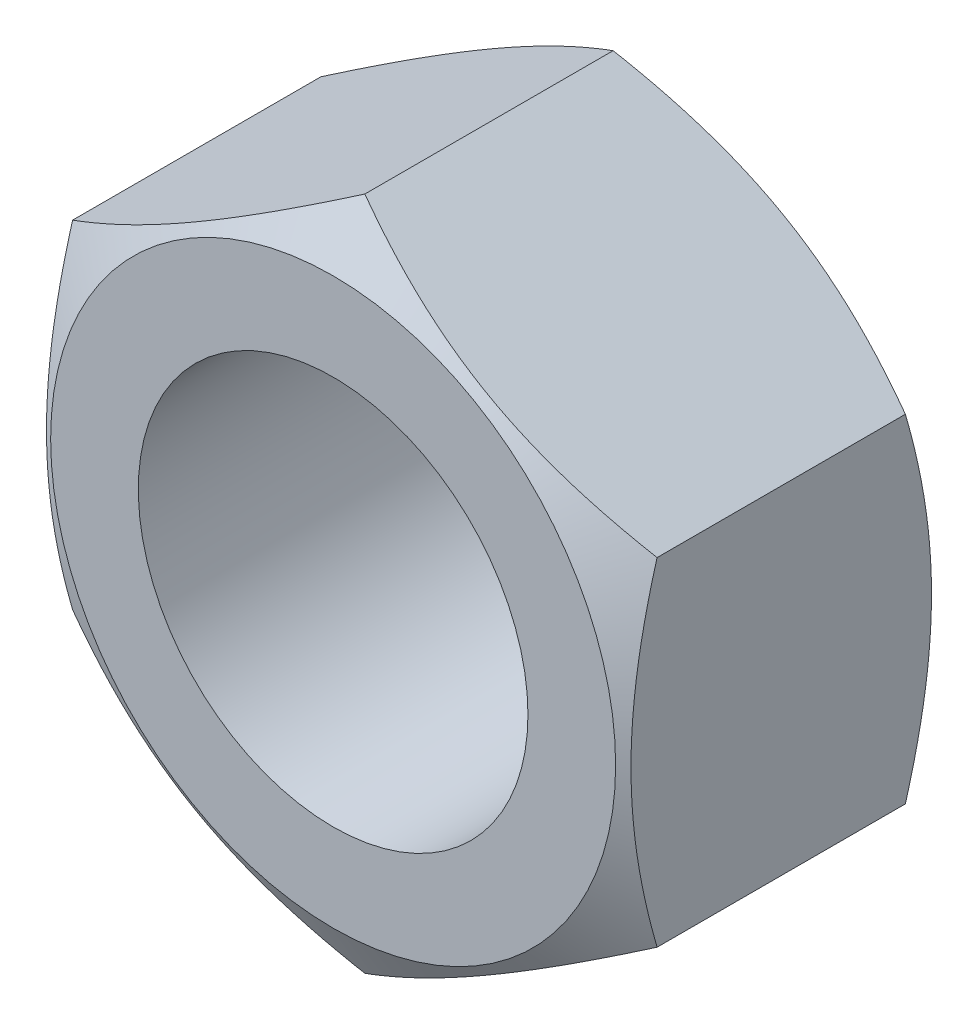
ISO-10303-21;
HEADER;
FILE_DESCRIPTION(('STEP AP214'),'2;1');
FILE_NAME('part.step','',(''),(''),'','','');
FILE_SCHEMA(('AUTOMOTIVE_DESIGN { 1 0 10303 214 1 1 1 1 }'));
ENDSEC;
DATA;
#1=APPLICATION_CONTEXT('core data for automotive mechanical design processes');
#2=APPLICATION_PROTOCOL_DEFINITION('international standard','automotive_design',2000,#1);
#3=PRODUCT_CONTEXT('',#1,'mechanical');
#4=PRODUCT('Part','Part','',(#3));
#5=PRODUCT_RELATED_PRODUCT_CATEGORY('part','',(#4));
#6=PRODUCT_DEFINITION_FORMATION('','',#4);
#7=PRODUCT_DEFINITION_CONTEXT('part definition',#1,'design');
#8=PRODUCT_DEFINITION('design','',#6,#7);
#9=PRODUCT_DEFINITION_SHAPE('','',#8);
#10=(LENGTH_UNIT() NAMED_UNIT(*) SI_UNIT(.MILLI.,.METRE.));
#11=(NAMED_UNIT(*) PLANE_ANGLE_UNIT() SI_UNIT($,.RADIAN.));
#12=(NAMED_UNIT(*) SI_UNIT($,.STERADIAN.) SOLID_ANGLE_UNIT());
#13=UNCERTAINTY_MEASURE_WITH_UNIT(LENGTH_MEASURE(1.E-05),#10,'distance_accuracy_value','');
#14=(GEOMETRIC_REPRESENTATION_CONTEXT(3) GLOBAL_UNCERTAINTY_ASSIGNED_CONTEXT((#13)) GLOBAL_UNIT_ASSIGNED_CONTEXT((#10,
#11,#12)) REPRESENTATION_CONTEXT('',''));
#15=CARTESIAN_POINT('',(0.,0.,0.));
#16=DIRECTION('',(0.,0.,1.));
#17=DIRECTION('',(1.,0.,0.));
#18=AXIS2_PLACEMENT_3D('',#15,#16,#17);
#19=CARTESIAN_POINT('',(-15.,-8.66025403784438,18.));
#20=DIRECTION('',(-1.,0.,0.));
#21=DIRECTION('',(0.,0.,1.));
#22=AXIS2_PLACEMENT_3D('',#19,#20,#21);
#23=PLANE('',#22);
#24=DIRECTION('',(0.,0.,-1.));
#25=VECTOR('',#24,1.);
#26=CARTESIAN_POINT('',(-15.,-8.66025403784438,18.));
#27=LINE('',#26,#25);
#28=CARTESIAN_POINT('',(-15.,-8.66025403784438,14.3715789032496));
#29=VERTEX_POINT('',#28);
#30=CARTESIAN_POINT('',(-15.,-8.66025403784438,1.62842109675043));
#31=VERTEX_POINT('',#30);
#32=EDGE_CURVE('E9',#29,#31,#27,.T.);
#33=ORIENTED_EDGE('',*,*,#32,.F.);
#34=CARTESIAN_POINT('',(-15.,-23.1406505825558,8.45000329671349));
#35=CARTESIAN_POINT('',(-15.,-22.8135927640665,8.60845031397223));
#36=CARTESIAN_POINT('',(-15.,-22.4861478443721,8.76609791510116));
#37=CARTESIAN_POINT('',(-15.,-21.8304029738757,9.07961298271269));
#38=CARTESIAN_POINT('',(-15.,-21.5021030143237,9.23548043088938));
#39=CARTESIAN_POINT('',(-15.,-20.5157102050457,9.70018246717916));
#40=CARTESIAN_POINT('',(-15.,-19.8562230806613,10.0060688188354));
#41=CARTESIAN_POINT('',(-15.,-18.5291467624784,10.6097795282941));
#42=CARTESIAN_POINT('',(-15.,-17.8615329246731,10.907549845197));
#43=CARTESIAN_POINT('',(-15.,-16.5209530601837,11.4907454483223));
#44=CARTESIAN_POINT('',(-15.,-15.8479872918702,11.7761713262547));
#45=CARTESIAN_POINT('',(-15.,-14.4743920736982,12.3401281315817));
#46=CARTESIAN_POINT('',(-15.,-13.7735572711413,12.6181615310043));
#47=CARTESIAN_POINT('',(-15.,-12.3636384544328,13.1528899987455));
#48=CARTESIAN_POINT('',(-15.,-11.654553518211,13.4095826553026));
#49=CARTESIAN_POINT('',(-15.,-10.2283968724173,13.8947978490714));
#50=CARTESIAN_POINT('',(-15.,-9.51134509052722,14.123378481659));
#51=CARTESIAN_POINT('',(-15.,-8.06688859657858,14.5449667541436));
#52=CARTESIAN_POINT('',(-15.,-7.3394872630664,14.7379857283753));
#53=CARTESIAN_POINT('',(-15.,-6.24250938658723,14.9932735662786));
#54=CARTESIAN_POINT('',(-15.,-5.87685361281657,15.0724966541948));
#55=CARTESIAN_POINT('',(-15.,-5.14306674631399,15.2185732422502));
#56=CARTESIAN_POINT('',(-15.,-4.77493570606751,15.2854270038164));
#57=CARTESIAN_POINT('',(-15.,-4.03645965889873,15.4055777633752));
#58=CARTESIAN_POINT('',(-15.,-3.66611466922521,15.4588748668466));
#59=CARTESIAN_POINT('',(-15.,-2.92361618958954,15.5508441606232));
#60=CARTESIAN_POINT('',(-15.,-2.5514627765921,15.5895169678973));
#61=CARTESIAN_POINT('',(-15.,-1.81067042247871,15.6509916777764));
#62=CARTESIAN_POINT('',(-15.,-1.44204802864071,15.6739917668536));
#63=CARTESIAN_POINT('',(-15.,-0.704162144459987,15.7043911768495));
#64=CARTESIAN_POINT('',(-15.,-0.334898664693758,15.7117907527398));
#65=CARTESIAN_POINT('',(-15.,0.403612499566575,15.7108135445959));
#66=CARTESIAN_POINT('',(-15.,0.772860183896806,15.7024366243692));
#67=CARTESIAN_POINT('',(-15.,1.51067677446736,15.6701086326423));
#68=CARTESIAN_POINT('',(-15.,1.87924564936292,15.6461568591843));
#69=CARTESIAN_POINT('',(-15.,2.76875443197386,15.570059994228));
#70=CARTESIAN_POINT('',(-15.,3.28905562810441,15.5103186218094));
#71=CARTESIAN_POINT('',(-15.,4.32571881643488,15.3630808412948));
#72=CARTESIAN_POINT('',(-15.,4.84208024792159,15.2755805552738));
#73=CARTESIAN_POINT('',(-15.,5.87039831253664,15.0759378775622));
#74=CARTESIAN_POINT('',(-15.,6.38235110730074,14.9637759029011));
#75=CARTESIAN_POINT('',(-15.,7.40108345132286,14.7182253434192));
#76=CARTESIAN_POINT('',(-15.,7.90786308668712,14.5848371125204));
#77=CARTESIAN_POINT('',(-15.,8.92732305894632,14.2969394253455));
#78=CARTESIAN_POINT('',(-15.,9.43989023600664,14.1420320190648));
#79=CARTESIAN_POINT('',(-15.,10.4599739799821,13.8164792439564));
#80=CARTESIAN_POINT('',(-15.,10.9674905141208,13.6458337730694));
#81=CARTESIAN_POINT('',(-15.,11.9777284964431,13.2914909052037));
#82=CARTESIAN_POINT('',(-15.,12.4804515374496,13.1077980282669));
#83=CARTESIAN_POINT('',(-15.,13.481749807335,12.7294951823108));
#84=CARTESIAN_POINT('',(-15.,13.9803250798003,12.5348853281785));
#85=CARTESIAN_POINT('',(-15.,15.1361574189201,12.0714695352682));
#86=CARTESIAN_POINT('',(-15.,15.7920237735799,11.7992006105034));
#87=CARTESIAN_POINT('',(-15.,17.0983559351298,11.2419658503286));
#88=CARTESIAN_POINT('',(-15.,17.7488214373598,10.9569993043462));
#89=CARTESIAN_POINT('',(-15.,19.0453309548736,10.3768556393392));
#90=CARTESIAN_POINT('',(-15.,19.6913740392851,10.0816764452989));
#91=CARTESIAN_POINT('',(-15.,20.9796270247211,9.48311992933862));
#92=CARTESIAN_POINT('',(-15.,21.6218369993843,9.17974276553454));
#93=CARTESIAN_POINT('',(-15.,22.9037017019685,8.56597645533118));
#94=CARTESIAN_POINT('',(-15.,23.5433531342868,8.25558043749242));
#95=CARTESIAN_POINT('',(-15.,24.8199402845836,7.62925447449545));
#96=CARTESIAN_POINT('',(-15.,25.4568759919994,7.31332450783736));
#97=CARTESIAN_POINT('',(-15.,26.7283656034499,6.67689845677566));
#98=CARTESIAN_POINT('',(-15.,27.3629197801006,6.35640291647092));
#99=CARTESIAN_POINT('',(-15.,28.6300597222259,5.71154185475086));
#100=CARTESIAN_POINT('',(-15.,29.2626454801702,5.3871763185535));
#101=CARTESIAN_POINT('',(-15.,31.0553792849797,4.46207897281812));
#102=CARTESIAN_POINT('',(-15.,32.2135265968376,3.85746993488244));
#103=CARTESIAN_POINT('',(-15.,34.5255051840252,2.63998448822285));
#104=CARTESIAN_POINT('',(-15.,35.6793363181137,2.02710781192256));
#105=CARTESIAN_POINT('',(-15.,37.9808909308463,0.796449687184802));
#106=CARTESIAN_POINT('',(-15.,39.1286223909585,0.178683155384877));
#107=CARTESIAN_POINT('',(-15.,40.8481732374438,-0.751673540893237));
#108=CARTESIAN_POINT('',(-15.,41.4210012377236,-1.06240229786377));
#109=CARTESIAN_POINT('',(-15.,42.566050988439,-1.68497281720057));
#110=CARTESIAN_POINT('',(-15.,43.1382727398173,-1.99681457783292));
#111=CARTESIAN_POINT('',(-15.,43.7102252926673,-2.30914944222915));
#112=B_SPLINE_CURVE_WITH_KNOTS('',3,(#34,#35,#36,#37,#38,#39,#40,#41,#42,#43,#44,#45,#46,#47,
#48,#49,#50,#51,#52,#53,#54,#55,#56,#57,#58,#59,#60,#61,#62,#63,#64,#65,#66,#67,#68,#69,#70,#71,
#72,#73,#74,#75,#76,#77,#78,#79,#80,#81,#82,#83,#84,#85,#86,#87,#88,#89,#90,#91,#92,#93,#94,#95,
#96,#97,#98,#99,#100,#101,#102,#103,#104,#105,#106,#107,#108,#109,#110,#111),.UNSPECIFIED.,.F.,
.F.,(4,2,2,2,2,2,2,2,2,2,2,2,2,2,2,2,2,2,2,2,2,2,2,2,2,2,2,2,2,2,2,2,2,2,2,2,2,2,4),(0.,
1.09025046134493,2.18051212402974,4.36136447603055,6.5542967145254,8.74712372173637,
11.0087708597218,13.2706732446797,15.5278197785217,17.7842456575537,18.9064890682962,
20.0287087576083,21.1509197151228,22.27308332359,23.3807795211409,24.4884576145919,
25.5961452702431,26.7038828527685,28.2741704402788,29.8446774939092,31.4164361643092,
32.9881686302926,34.5942572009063,36.2003561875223,37.8059014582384,39.4114298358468,
41.5416541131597,43.6719977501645,45.8027768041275,47.9335147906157,50.0664377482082,
52.1993689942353,54.3320481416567,56.4647354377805,60.3840875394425,64.3035667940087,
68.2138323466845,70.1688655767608,72.1238957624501),.UNSPECIFIED.);
#113=CARTESIAN_POINT('',(-15.,8.66025403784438,14.3715789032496));
#114=VERTEX_POINT('',#113);
#115=EDGE_CURVE('E69',#29,#114,#112,.T.);
#116=ORIENTED_EDGE('',*,*,#115,.T.);
#117=DIRECTION('',(0.,0.,-1.));
#118=VECTOR('',#117,1.);
#119=CARTESIAN_POINT('',(-15.,8.66025403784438,18.));
#120=LINE('',#119,#118);
#121=CARTESIAN_POINT('',(-15.,8.66025403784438,1.62842109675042));
#122=VERTEX_POINT('',#121);
#123=EDGE_CURVE('E38',#114,#122,#120,.T.);
#124=ORIENTED_EDGE('',*,*,#123,.T.);
#125=CARTESIAN_POINT('',(-15.,-23.4699725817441,7.70987638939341));
#126=CARTESIAN_POINT('',(-15.,-23.1415247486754,7.55009582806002));
#127=CARTESIAN_POINT('',(-15.,-22.8126970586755,7.39109647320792));
#128=CARTESIAN_POINT('',(-15.,-22.1542027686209,7.07483670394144));
#129=CARTESIAN_POINT('',(-15.,-21.8245361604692,6.91757630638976));
#130=CARTESIAN_POINT('',(-15.,-20.8340741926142,6.44862821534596));
#131=CARTESIAN_POINT('',(-15.,-20.1719106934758,6.13981947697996));
#132=CARTESIAN_POINT('',(-15.,-18.8397161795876,5.53008911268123));
#133=CARTESIAN_POINT('',(-15.,-18.1696620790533,5.22921780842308));
#134=CARTESIAN_POINT('',(-15.,-16.8242973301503,4.63950891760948));
#135=CARTESIAN_POINT('',(-15.,-16.1489869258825,4.35067077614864));
#136=CARTESIAN_POINT('',(-15.,-14.7694563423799,3.77884634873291));
#137=CARTESIAN_POINT('',(-15.,-14.0650218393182,3.49637447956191));
#138=CARTESIAN_POINT('',(-15.,-12.6479834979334,2.95231005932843));
#139=CARTESIAN_POINT('',(-15.,-11.9353787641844,2.69071982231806));
#140=CARTESIAN_POINT('',(-15.,-10.5021570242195,2.19513846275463));
#141=CARTESIAN_POINT('',(-15.,-9.78155888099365,1.96109321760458));
#142=CARTESIAN_POINT('',(-15.,-8.32996018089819,1.52796027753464));
#143=CARTESIAN_POINT('',(-15.,-7.59896291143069,1.32886178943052));
#144=CARTESIAN_POINT('',(-15.,-6.49655522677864,1.06407217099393));
#145=CARTESIAN_POINT('',(-15.,-6.12914358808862,0.981636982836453));
#146=CARTESIAN_POINT('',(-15.,-5.39177201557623,0.829014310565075));
#147=CARTESIAN_POINT('',(-15.,-5.02181213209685,0.758826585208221));
#148=CARTESIAN_POINT('',(-15.,-4.27958352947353,0.631924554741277));
#149=CARTESIAN_POINT('',(-15.,-3.90731484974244,0.575210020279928));
#150=CARTESIAN_POINT('',(-15.,-3.16084805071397,0.4763779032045));
#151=CARTESIAN_POINT('',(-15.,-2.78665001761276,0.434259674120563));
#152=CARTESIAN_POINT('',(-15.,-2.04182159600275,0.365996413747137));
#153=CARTESIAN_POINT('',(-15.,-1.6712101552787,0.339645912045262));
#154=CARTESIAN_POINT('',(-15.,-0.929205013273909,0.302651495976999));
#155=CARTESIAN_POINT('',(-15.,-0.557811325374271,0.292007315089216));
#156=CARTESIAN_POINT('',(-15.,0.185094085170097,0.286679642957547));
#157=CARTESIAN_POINT('',(-15.,0.556605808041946,0.291996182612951));
#158=CARTESIAN_POINT('',(-15.,1.29906958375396,0.318457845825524));
#159=CARTESIAN_POINT('',(-15.,1.6700216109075,0.339603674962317));
#160=CARTESIAN_POINT('',(-15.,2.55529607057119,0.408502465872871));
#161=CARTESIAN_POINT('',(-15.,3.06907123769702,0.463418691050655));
#162=CARTESIAN_POINT('',(-15.,4.0929473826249,0.60067399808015));
#163=CARTESIAN_POINT('',(-15.,4.60304787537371,0.683016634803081));
#164=CARTESIAN_POINT('',(-15.,5.61903977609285,0.872195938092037));
#165=CARTESIAN_POINT('',(-15.,6.12492772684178,0.979050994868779));
#166=CARTESIAN_POINT('',(-15.,7.13169797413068,1.21398339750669));
#167=CARTESIAN_POINT('',(-15.,7.63258033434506,1.34206047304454));
#168=CARTESIAN_POINT('',(-15.,8.64055583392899,1.6193908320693));
#169=CARTESIAN_POINT('',(-15.,9.14753485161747,1.76905601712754));
#170=CARTESIAN_POINT('',(-15.,10.1565015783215,2.08427311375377));
#171=CARTESIAN_POINT('',(-15.,10.6584892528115,2.24982513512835));
#172=CARTESIAN_POINT('',(-15.,11.6577149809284,2.5941503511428));
#173=CARTESIAN_POINT('',(-15.,12.1549544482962,2.77291946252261));
#174=CARTESIAN_POINT('',(-15.,13.1452841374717,3.14153420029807));
#175=CARTESIAN_POINT('',(-15.,13.6383744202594,3.33137966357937));
#176=CARTESIAN_POINT('',(-15.,14.8483575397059,3.81036828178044));
#177=CARTESIAN_POINT('',(-15.,15.56315957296,4.10478661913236));
#178=CARTESIAN_POINT('',(-15.,16.9862746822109,4.70895725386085));
#179=CARTESIAN_POINT('',(-15.,17.6945872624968,5.0187107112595));
#180=CARTESIAN_POINT('',(-15.,19.1060111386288,5.65031881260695));
#181=CARTESIAN_POINT('',(-15.,19.8091209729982,5.97217671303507));
#182=CARTESIAN_POINT('',(-15.,21.2108662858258,6.62541845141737));
#183=CARTESIAN_POINT('',(-15.,21.9095018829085,6.95680203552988));
#184=CARTESIAN_POINT('',(-15.,23.3039583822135,7.62764773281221));
#185=CARTESIAN_POINT('',(-15.,23.9997746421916,7.96711947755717));
#186=CARTESIAN_POINT('',(-15.,25.3883291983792,8.65230055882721));
#187=CARTESIAN_POINT('',(-15.,26.081067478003,8.998009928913));
#188=CARTESIAN_POINT('',(-15.,27.4638560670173,9.69449620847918));
#189=CARTESIAN_POINT('',(-15.,28.1539067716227,10.0452723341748));
#190=CARTESIAN_POINT('',(-15.,29.5318258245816,10.751076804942));
#191=CARTESIAN_POINT('',(-15.,30.2196941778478,11.1061051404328));
#192=CARTESIAN_POINT('',(-15.,32.1564022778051,12.1120352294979));
#193=CARTESIAN_POINT('',(-15.,33.4031142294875,12.7670332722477));
#194=CARTESIAN_POINT('',(-15.,35.8919889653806,14.0857235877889));
#195=CARTESIAN_POINT('',(-15.,37.1341515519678,14.7494162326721));
#196=CARTESIAN_POINT('',(-15.,39.6114638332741,16.0815417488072));
#197=CARTESIAN_POINT('',(-15.,40.8466234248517,16.7499562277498));
#198=CARTESIAN_POINT('',(-15.,42.6972399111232,17.7563859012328));
#199=CARTESIAN_POINT('',(-15.,43.3137394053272,18.0924867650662));
#200=CARTESIAN_POINT('',(-15.,44.5461141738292,18.7658288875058));
#201=CARTESIAN_POINT('',(-15.,45.1619894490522,19.1030701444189));
#202=CARTESIAN_POINT('',(-15.,45.777588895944,19.440814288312));
#203=B_SPLINE_CURVE_WITH_KNOTS('',3,(#125,#126,#127,#128,#129,#130,#131,#132,#133,#134,#135,
#136,#137,#138,#139,#140,#141,#142,#143,#144,#145,#146,#147,#148,#149,#150,#151,#152,#153,#154,
#155,#156,#157,#158,#159,#160,#161,#162,#163,#164,#165,#166,#167,#168,#169,#170,#171,#172,#173,
#174,#175,#176,#177,#178,#179,#180,#181,#182,#183,#184,#185,#186,#187,#188,#189,#190,#191,#192,
#193,#194,#195,#196,#197,#198,#199,#200,#201,#202),.UNSPECIFIED.,.F.,.F.,(4,2,2,2,2,2,2,2,2,2,2,
2,2,2,2,2,2,2,2,2,2,2,2,2,2,2,2,2,2,2,2,2,2,2,2,2,2,2,4),(0.,1.09574908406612,2.19150878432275,
4.38334194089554,6.58676146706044,8.79007927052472,11.0667025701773,13.3435778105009,
15.6159018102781,17.887522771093,19.0169896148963,20.1464342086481,21.2758595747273,
22.4052349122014,23.5195532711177,24.6338527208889,25.7481543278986,26.8625056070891,
28.4117584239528,29.961212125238,31.5118321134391,33.0624323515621,34.6479488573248,
36.233476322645,37.8185159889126,39.4035323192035,41.7224664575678,44.041576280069,
46.3613145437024,48.6809910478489,51.0035835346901,53.3261885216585,55.6484379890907,
57.9706822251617,62.1955342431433,66.4205676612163,70.6338128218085,72.7403063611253,
74.8467967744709),.UNSPECIFIED.);
#204=EDGE_CURVE('E89',#31,#122,#203,.T.);
#205=ORIENTED_EDGE('',*,*,#204,.F.);
#206=EDGE_LOOP('',(#33,#116,#124,#205));
#207=FACE_BOUND('',#206,.T.);
#208=ADVANCED_FACE('F14',(#207),#23,.T.);
#209=CARTESIAN_POINT('',(-15.,-8.66025403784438,18.));
#210=DIRECTION('',(0.5,0.86602540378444,0.));
#211=DIRECTION('',(-0.86602540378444,0.5,0.));
#212=AXIS2_PLACEMENT_3D('',#209,#210,#211);
#213=PLANE('',#212);
#214=CARTESIAN_POINT('',(-15.0002,-8.66013856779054,14.3715122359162));
#215=CARTESIAN_POINT('',(-14.6705058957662,-8.85048754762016,14.4814030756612));
#216=CARTESIAN_POINT('',(-14.3395258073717,-9.04157899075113,14.5863072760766));
#217=CARTESIAN_POINT('',(-13.674911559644,-9.42529420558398,14.7847562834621));
#218=CARTESIAN_POINT('',(-13.3412765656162,-9.617918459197,14.8782973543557));
#219=CARTESIAN_POINT('',(-12.6707077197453,-10.0050715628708,15.0527627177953));
#220=CARTESIAN_POINT('',(-12.333767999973,-10.199603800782,15.133657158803));
#221=CARTESIAN_POINT('',(-11.6575472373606,-10.5900200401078,15.2810922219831));
#222=CARTESIAN_POINT('',(-11.3182663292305,-10.7859039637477,15.3476336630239));
#223=CARTESIAN_POINT('',(-10.6460568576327,-11.1740042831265,15.4635324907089));
#224=CARTESIAN_POINT('',(-10.3131781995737,-11.3661918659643,15.5132734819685));
#225=CARTESIAN_POINT('',(-9.64589556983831,-11.7514476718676,15.5966781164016));
#226=CARTESIAN_POINT('',(-9.31149156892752,-11.9445159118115,15.6303414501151));
#227=CARTESIAN_POINT('',(-8.64212181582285,-12.3309767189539,15.6807407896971));
#228=CARTESIAN_POINT('',(-8.30715720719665,-12.5243686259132,15.6974969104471));
#229=CARTESIAN_POINT('',(-7.636918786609,-12.9113309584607,15.7137214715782));
#230=CARTESIAN_POINT('',(-7.30164498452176,-13.104901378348,15.7131904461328));
#231=CARTESIAN_POINT('',(-6.6748531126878,-13.4667798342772,15.696048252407));
#232=CARTESIAN_POINT('',(-6.38329037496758,-13.6351136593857,15.6815280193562));
#233=CARTESIAN_POINT('',(-5.80083556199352,-13.971394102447,15.6396877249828));
#234=CARTESIAN_POINT('',(-5.50994353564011,-14.1393406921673,15.6123667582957));
#235=CARTESIAN_POINT('',(-4.92898814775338,-14.4747554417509,15.5454013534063));
#236=CARTESIAN_POINT('',(-4.63892567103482,-14.6422230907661,15.5057467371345));
#237=CARTESIAN_POINT('',(-4.06016058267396,-14.9763732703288,15.4148097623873));
#238=CARTESIAN_POINT('',(-3.77145806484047,-15.1430557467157,15.3635266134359));
#239=CARTESIAN_POINT('',(-2.89508556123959,-15.6490296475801,15.1909380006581));
#240=CARTESIAN_POINT('',(-2.30995340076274,-15.9868558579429,15.0524236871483));
#241=CARTESIAN_POINT('',(-1.14841408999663,-16.657470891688,14.73805289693));
#242=CARTESIAN_POINT('',(-0.57199206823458,-16.9902683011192,14.5622702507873));
#243=CARTESIAN_POINT('',(0.000200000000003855,-17.3206235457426,14.3715122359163));
#244=B_SPLINE_CURVE_WITH_KNOTS('',3,(#214,#215,#216,#217,#218,#219,#220,#221,#222,#223,#224,
#225,#226,#227,#228,#229,#230,#231,#232,#233,#234,#235,#236,#237,#238,#239,#240,#241,#242,#243),
.UNSPECIFIED.,.F.,.F.,(4,2,2,2,2,2,2,2,2,2,2,2,2,2,4),(0.,1.18875411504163,2.37789802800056,
3.56980778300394,4.76164951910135,5.92407379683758,7.0865204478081,8.24758247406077,
9.40860862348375,10.4193068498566,11.4300765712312,12.4416826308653,13.4533574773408,
15.5211962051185,17.5849760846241),.UNSPECIFIED.);
#245=CARTESIAN_POINT('',(0.,-17.3205080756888,14.3715789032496));
#246=VERTEX_POINT('',#245);
#247=EDGE_CURVE('E77',#29,#246,#244,.T.);
#248=ORIENTED_EDGE('',*,*,#247,.F.);
#249=ORIENTED_EDGE('',*,*,#32,.T.);
#250=CARTESIAN_POINT('',(-15.0002,-8.66013856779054,1.62848776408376));
#251=CARTESIAN_POINT('',(-14.6705058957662,-8.85048754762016,1.51859692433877));
#252=CARTESIAN_POINT('',(-14.3395258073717,-9.04157899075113,1.41369272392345));
#253=CARTESIAN_POINT('',(-13.674911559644,-9.42529420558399,1.21524371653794));
#254=CARTESIAN_POINT('',(-13.3412765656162,-9.61791845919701,1.12170264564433));
#255=CARTESIAN_POINT('',(-12.6707077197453,-10.0050715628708,0.947237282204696));
#256=CARTESIAN_POINT('',(-12.333767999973,-10.199603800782,0.866342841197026));
#257=CARTESIAN_POINT('',(-11.6575472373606,-10.5900200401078,0.718907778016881));
#258=CARTESIAN_POINT('',(-11.3182663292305,-10.7859039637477,0.652366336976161));
#259=CARTESIAN_POINT('',(-10.6460568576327,-11.1740042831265,0.536467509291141));
#260=CARTESIAN_POINT('',(-10.3131781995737,-11.3661918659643,0.4867265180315));
#261=CARTESIAN_POINT('',(-9.6458955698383,-11.7514476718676,0.403321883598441));
#262=CARTESIAN_POINT('',(-9.3114915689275,-11.9445159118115,0.369658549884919));
#263=CARTESIAN_POINT('',(-8.64212181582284,-12.3309767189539,0.319259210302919));
#264=CARTESIAN_POINT('',(-8.30715720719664,-12.5243686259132,0.302503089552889));
#265=CARTESIAN_POINT('',(-7.63691878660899,-12.9113309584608,0.286278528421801));
#266=CARTESIAN_POINT('',(-7.30164498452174,-13.104901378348,0.286809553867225));
#267=CARTESIAN_POINT('',(-6.67485311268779,-13.4667798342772,0.303951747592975));
#268=CARTESIAN_POINT('',(-6.38329037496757,-13.6351136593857,0.318471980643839));
#269=CARTESIAN_POINT('',(-5.80083556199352,-13.971394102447,0.360312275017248));
#270=CARTESIAN_POINT('',(-5.50994353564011,-14.1393406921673,0.387633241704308));
#271=CARTESIAN_POINT('',(-4.92898814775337,-14.4747554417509,0.454598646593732));
#272=CARTESIAN_POINT('',(-4.63892567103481,-14.6422230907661,0.49425326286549));
#273=CARTESIAN_POINT('',(-4.06016058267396,-14.9763732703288,0.585190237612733));
#274=CARTESIAN_POINT('',(-3.77145806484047,-15.1430557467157,0.636473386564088));
#275=CARTESIAN_POINT('',(-2.89508556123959,-15.6490296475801,0.809061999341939));
#276=CARTESIAN_POINT('',(-2.30995340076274,-15.9868558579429,0.947576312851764));
#277=CARTESIAN_POINT('',(-1.14841408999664,-16.657470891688,1.26194710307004));
#278=CARTESIAN_POINT('',(-0.571992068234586,-16.9902683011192,1.4377297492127));
#279=CARTESIAN_POINT('',(0.00019999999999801,-17.3206235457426,1.62848776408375));
#280=B_SPLINE_CURVE_WITH_KNOTS('',3,(#250,#251,#252,#253,#254,#255,#256,#257,#258,#259,#260,
#261,#262,#263,#264,#265,#266,#267,#268,#269,#270,#271,#272,#273,#274,#275,#276,#277,#278,#279),
.UNSPECIFIED.,.F.,.F.,(4,2,2,2,2,2,2,2,2,2,2,2,2,2,4),(0.,1.18875411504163,2.37789802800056,
3.56980778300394,4.76164951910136,5.92407379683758,7.08652044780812,8.24758247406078,
9.40860862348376,10.4193068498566,11.4300765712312,12.4416826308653,13.4533574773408,
15.5211962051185,17.5849760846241),.UNSPECIFIED.);
#281=CARTESIAN_POINT('',(0.,-17.3205080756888,1.62842109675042));
#282=VERTEX_POINT('',#281);
#283=EDGE_CURVE('E111',#31,#282,#280,.T.);
#284=ORIENTED_EDGE('',*,*,#283,.T.);
#285=DIRECTION('',(0.,0.,-1.));
#286=VECTOR('',#285,1.);
#287=CARTESIAN_POINT('',(0.,-17.3205080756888,18.));
#288=LINE('',#287,#286);
#289=EDGE_CURVE('E23',#246,#282,#288,.T.);
#290=ORIENTED_EDGE('',*,*,#289,.F.);
#291=EDGE_LOOP('',(#248,#249,#284,#290));
#292=FACE_BOUND('',#291,.T.);
#293=ADVANCED_FACE('F16',(#292),#213,.F.);
#294=CARTESIAN_POINT('',(15.,-8.66025403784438,18.));
#295=DIRECTION('',(0.5,-0.866025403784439,0.));
#296=DIRECTION('',(0.86602540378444,0.5,0.));
#297=AXIS2_PLACEMENT_3D('',#294,#295,#296);
#298=PLANE('',#297);
#299=DIRECTION('',(0.,0.,-1.));
#300=VECTOR('',#299,1.);
#301=CARTESIAN_POINT('',(15.,-8.66025403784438,18.));
#302=LINE('',#301,#300);
#303=CARTESIAN_POINT('',(15.,-8.66025403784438,14.3715789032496));
#304=VERTEX_POINT('',#303);
#305=CARTESIAN_POINT('',(15.,-8.66025403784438,1.62842109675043));
#306=VERTEX_POINT('',#305);
#307=EDGE_CURVE('E94',#304,#306,#302,.T.);
#308=ORIENTED_EDGE('',*,*,#307,.F.);
#309=CARTESIAN_POINT('',(15.0002,-8.66013856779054,14.3715122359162));
#310=CARTESIAN_POINT('',(14.6705058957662,-8.85048754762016,14.4814030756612));
#311=CARTESIAN_POINT('',(14.3395258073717,-9.04157899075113,14.5863072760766));
#312=CARTESIAN_POINT('',(13.674911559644,-9.42529420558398,14.7847562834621));
#313=CARTESIAN_POINT('',(13.3412765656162,-9.61791845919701,14.8782973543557));
#314=CARTESIAN_POINT('',(12.6707077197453,-10.0050715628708,15.0527627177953));
#315=CARTESIAN_POINT('',(12.333767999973,-10.199603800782,15.133657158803));
#316=CARTESIAN_POINT('',(11.6575472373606,-10.5900200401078,15.2810922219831));
#317=CARTESIAN_POINT('',(11.3182663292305,-10.7859039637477,15.3476336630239));
#318=CARTESIAN_POINT('',(10.6460568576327,-11.1740042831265,15.4635324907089));
#319=CARTESIAN_POINT('',(10.3131781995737,-11.3661918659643,15.5132734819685));
#320=CARTESIAN_POINT('',(9.64589556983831,-11.7514476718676,15.5966781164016));
#321=CARTESIAN_POINT('',(9.31149156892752,-11.9445159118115,15.6303414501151));
#322=CARTESIAN_POINT('',(8.64212181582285,-12.3309767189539,15.6807407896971));
#323=CARTESIAN_POINT('',(8.30715720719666,-12.5243686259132,15.6974969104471));
#324=CARTESIAN_POINT('',(7.636918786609,-12.9113309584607,15.7137214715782));
#325=CARTESIAN_POINT('',(7.30164498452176,-13.104901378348,15.7131904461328));
#326=CARTESIAN_POINT('',(6.6748531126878,-13.4667798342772,15.696048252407));
#327=CARTESIAN_POINT('',(6.38329037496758,-13.6351136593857,15.6815280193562));
#328=CARTESIAN_POINT('',(5.80083556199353,-13.971394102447,15.6396877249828));
#329=CARTESIAN_POINT('',(5.50994353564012,-14.1393406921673,15.6123667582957));
#330=CARTESIAN_POINT('',(4.92898814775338,-14.4747554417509,15.5454013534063));
#331=CARTESIAN_POINT('',(4.63892567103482,-14.6422230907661,15.5057467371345));
#332=CARTESIAN_POINT('',(4.06016058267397,-14.9763732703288,15.4148097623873));
#333=CARTESIAN_POINT('',(3.77145806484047,-15.1430557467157,15.3635266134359));
#334=CARTESIAN_POINT('',(2.8950855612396,-15.6490296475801,15.1909380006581));
#335=CARTESIAN_POINT('',(2.30995340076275,-15.9868558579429,15.0524236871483));
#336=CARTESIAN_POINT('',(1.14841408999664,-16.657470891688,14.73805289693));
#337=CARTESIAN_POINT('',(0.571992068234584,-16.9902683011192,14.5622702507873));
#338=CARTESIAN_POINT('',(-0.000199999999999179,-17.3206235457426,14.3715122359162));
#339=B_SPLINE_CURVE_WITH_KNOTS('',3,(#309,#310,#311,#312,#313,#314,#315,#316,#317,#318,#319,
#320,#321,#322,#323,#324,#325,#326,#327,#328,#329,#330,#331,#332,#333,#334,#335,#336,#337,#338),
.UNSPECIFIED.,.F.,.F.,(4,2,2,2,2,2,2,2,2,2,2,2,2,2,4),(0.,1.18875411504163,2.37789802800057,
3.56980778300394,4.76164951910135,5.92407379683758,7.08652044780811,8.24758247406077,
9.40860862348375,10.4193068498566,11.4300765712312,12.4416826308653,13.4533574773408,
15.5211962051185,17.5849760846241),.UNSPECIFIED.);
#340=EDGE_CURVE('E103',#304,#246,#339,.T.);
#341=ORIENTED_EDGE('',*,*,#340,.T.);
#342=ORIENTED_EDGE('',*,*,#289,.T.);
#343=CARTESIAN_POINT('',(15.0002,-8.66013856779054,1.62848776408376));
#344=CARTESIAN_POINT('',(14.6705058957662,-8.85048754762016,1.51859692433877));
#345=CARTESIAN_POINT('',(14.3395258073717,-9.04157899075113,1.41369272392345));
#346=CARTESIAN_POINT('',(13.674911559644,-9.42529420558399,1.21524371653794));
#347=CARTESIAN_POINT('',(13.3412765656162,-9.61791845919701,1.12170264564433));
#348=CARTESIAN_POINT('',(12.6707077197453,-10.0050715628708,0.947237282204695));
#349=CARTESIAN_POINT('',(12.333767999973,-10.199603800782,0.866342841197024));
#350=CARTESIAN_POINT('',(11.6575472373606,-10.5900200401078,0.718907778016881));
#351=CARTESIAN_POINT('',(11.3182663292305,-10.7859039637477,0.652366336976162));
#352=CARTESIAN_POINT('',(10.6460568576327,-11.1740042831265,0.536467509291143));
#353=CARTESIAN_POINT('',(10.3131781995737,-11.3661918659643,0.486726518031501));
#354=CARTESIAN_POINT('',(9.6458955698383,-11.7514476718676,0.403321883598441));
#355=CARTESIAN_POINT('',(9.3114915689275,-11.9445159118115,0.369658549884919));
#356=CARTESIAN_POINT('',(8.64212181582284,-12.3309767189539,0.31925921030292));
#357=CARTESIAN_POINT('',(8.30715720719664,-12.5243686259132,0.30250308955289));
#358=CARTESIAN_POINT('',(7.63691878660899,-12.9113309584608,0.286278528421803));
#359=CARTESIAN_POINT('',(7.30164498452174,-13.104901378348,0.286809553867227));
#360=CARTESIAN_POINT('',(6.67485311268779,-13.4667798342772,0.303951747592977));
#361=CARTESIAN_POINT('',(6.38329037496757,-13.6351136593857,0.31847198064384));
#362=CARTESIAN_POINT('',(5.80083556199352,-13.9713941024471,0.360312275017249));
#363=CARTESIAN_POINT('',(5.50994353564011,-14.1393406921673,0.387633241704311));
#364=CARTESIAN_POINT('',(4.92898814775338,-14.4747554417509,0.454598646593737));
#365=CARTESIAN_POINT('',(4.63892567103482,-14.6422230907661,0.494253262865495));
#366=CARTESIAN_POINT('',(4.06016058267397,-14.9763732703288,0.585190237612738));
#367=CARTESIAN_POINT('',(3.77145806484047,-15.1430557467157,0.636473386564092));
#368=CARTESIAN_POINT('',(2.89508556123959,-15.6490296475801,0.809061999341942));
#369=CARTESIAN_POINT('',(2.30995340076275,-15.9868558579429,0.947576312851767));
#370=CARTESIAN_POINT('',(1.14841408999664,-16.657470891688,1.26194710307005));
#371=CARTESIAN_POINT('',(0.57199206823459,-16.9902683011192,1.4377297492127));
#372=CARTESIAN_POINT('',(-0.000199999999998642,-17.3206235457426,1.62848776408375));
#373=B_SPLINE_CURVE_WITH_KNOTS('',3,(#343,#344,#345,#346,#347,#348,#349,#350,#351,#352,#353,
#354,#355,#356,#357,#358,#359,#360,#361,#362,#363,#364,#365,#366,#367,#368,#369,#370,#371,#372),
.UNSPECIFIED.,.F.,.F.,(4,2,2,2,2,2,2,2,2,2,2,2,2,2,4),(0.,1.18875411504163,2.37789802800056,
3.56980778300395,4.76164951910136,5.92407379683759,7.08652044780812,8.24758247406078,
9.40860862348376,10.4193068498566,11.4300765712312,12.4416826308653,13.4533574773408,
15.5211962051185,17.5849760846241),.UNSPECIFIED.);
#374=EDGE_CURVE('E102',#306,#282,#373,.T.);
#375=ORIENTED_EDGE('',*,*,#374,.F.);
#376=EDGE_LOOP('',(#308,#341,#342,#375));
#377=FACE_BOUND('',#376,.T.);
#378=ADVANCED_FACE('F101',(#377),#298,.T.);
#379=CARTESIAN_POINT('',(15.,-8.66025403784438,18.));
#380=DIRECTION('',(-1.,0.,0.));
#381=DIRECTION('',(0.,0.,1.));
#382=AXIS2_PLACEMENT_3D('',#379,#380,#381);
#383=PLANE('',#382);
#384=CARTESIAN_POINT('',(15.,-23.1406505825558,8.45000329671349));
#385=CARTESIAN_POINT('',(15.,-22.8135927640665,8.60845031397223));
#386=CARTESIAN_POINT('',(15.,-22.4861478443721,8.76609791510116));
#387=CARTESIAN_POINT('',(15.,-21.8304029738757,9.07961298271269));
#388=CARTESIAN_POINT('',(15.,-21.5021030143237,9.23548043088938));
#389=CARTESIAN_POINT('',(15.,-20.5157102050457,9.70018246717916));
#390=CARTESIAN_POINT('',(15.,-19.8562230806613,10.0060688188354));
#391=CARTESIAN_POINT('',(15.,-18.5291467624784,10.6097795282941));
#392=CARTESIAN_POINT('',(15.,-17.8615329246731,10.907549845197));
#393=CARTESIAN_POINT('',(15.,-16.5209530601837,11.4907454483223));
#394=CARTESIAN_POINT('',(15.,-15.8479872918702,11.7761713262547));
#395=CARTESIAN_POINT('',(15.,-14.4743920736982,12.3401281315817));
#396=CARTESIAN_POINT('',(15.,-13.7735572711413,12.6181615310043));
#397=CARTESIAN_POINT('',(15.,-12.3636384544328,13.1528899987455));
#398=CARTESIAN_POINT('',(15.,-11.654553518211,13.4095826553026));
#399=CARTESIAN_POINT('',(15.,-10.2283968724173,13.8947978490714));
#400=CARTESIAN_POINT('',(15.,-9.51134509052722,14.123378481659));
#401=CARTESIAN_POINT('',(15.,-8.06688859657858,14.5449667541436));
#402=CARTESIAN_POINT('',(15.,-7.3394872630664,14.7379857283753));
#403=CARTESIAN_POINT('',(15.,-6.24250938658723,14.9932735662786));
#404=CARTESIAN_POINT('',(15.,-5.87685361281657,15.0724966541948));
#405=CARTESIAN_POINT('',(15.,-5.14306674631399,15.2185732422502));
#406=CARTESIAN_POINT('',(15.,-4.77493570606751,15.2854270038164));
#407=CARTESIAN_POINT('',(15.,-4.03645965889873,15.4055777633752));
#408=CARTESIAN_POINT('',(15.,-3.66611466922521,15.4588748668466));
#409=CARTESIAN_POINT('',(15.,-2.92361618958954,15.5508441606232));
#410=CARTESIAN_POINT('',(15.,-2.5514627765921,15.5895169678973));
#411=CARTESIAN_POINT('',(15.,-1.81067042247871,15.6509916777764));
#412=CARTESIAN_POINT('',(15.,-1.44204802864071,15.6739917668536));
#413=CARTESIAN_POINT('',(15.,-0.704162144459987,15.7043911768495));
#414=CARTESIAN_POINT('',(15.,-0.334898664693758,15.7117907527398));
#415=CARTESIAN_POINT('',(15.,0.403612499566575,15.7108135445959));
#416=CARTESIAN_POINT('',(15.,0.772860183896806,15.7024366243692));
#417=CARTESIAN_POINT('',(15.,1.51067677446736,15.6701086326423));
#418=CARTESIAN_POINT('',(15.,1.87924564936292,15.6461568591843));
#419=CARTESIAN_POINT('',(15.,2.76875443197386,15.570059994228));
#420=CARTESIAN_POINT('',(15.,3.28905562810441,15.5103186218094));
#421=CARTESIAN_POINT('',(15.,4.32571881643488,15.3630808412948));
#422=CARTESIAN_POINT('',(15.,4.84208024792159,15.2755805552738));
#423=CARTESIAN_POINT('',(15.,5.87039831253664,15.0759378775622));
#424=CARTESIAN_POINT('',(15.,6.38235110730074,14.9637759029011));
#425=CARTESIAN_POINT('',(15.,7.40108345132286,14.7182253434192));
#426=CARTESIAN_POINT('',(15.,7.90786308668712,14.5848371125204));
#427=CARTESIAN_POINT('',(15.,8.92732305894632,14.2969394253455));
#428=CARTESIAN_POINT('',(15.,9.43989023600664,14.1420320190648));
#429=CARTESIAN_POINT('',(15.,10.4599739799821,13.8164792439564));
#430=CARTESIAN_POINT('',(15.,10.9674905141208,13.6458337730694));
#431=CARTESIAN_POINT('',(15.,11.9777284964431,13.2914909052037));
#432=CARTESIAN_POINT('',(15.,12.4804515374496,13.1077980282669));
#433=CARTESIAN_POINT('',(15.,13.481749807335,12.7294951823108));
#434=CARTESIAN_POINT('',(15.,13.9803250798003,12.5348853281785));
#435=CARTESIAN_POINT('',(15.,15.1361574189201,12.0714695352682));
#436=CARTESIAN_POINT('',(15.,15.7920237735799,11.7992006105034));
#437=CARTESIAN_POINT('',(15.,17.0983559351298,11.2419658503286));
#438=CARTESIAN_POINT('',(15.,17.7488214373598,10.9569993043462));
#439=CARTESIAN_POINT('',(15.,19.0453309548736,10.3768556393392));
#440=CARTESIAN_POINT('',(15.,19.6913740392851,10.0816764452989));
#441=CARTESIAN_POINT('',(15.,20.9796270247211,9.48311992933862));
#442=CARTESIAN_POINT('',(15.,21.6218369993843,9.17974276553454));
#443=CARTESIAN_POINT('',(15.,22.9037017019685,8.56597645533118));
#444=CARTESIAN_POINT('',(15.,23.5433531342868,8.25558043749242));
#445=CARTESIAN_POINT('',(15.,24.8199402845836,7.62925447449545));
#446=CARTESIAN_POINT('',(15.,25.4568759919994,7.31332450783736));
#447=CARTESIAN_POINT('',(15.,26.7283656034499,6.67689845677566));
#448=CARTESIAN_POINT('',(15.,27.3629197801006,6.35640291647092));
#449=CARTESIAN_POINT('',(15.,28.6300597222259,5.71154185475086));
#450=CARTESIAN_POINT('',(15.,29.2626454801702,5.3871763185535));
#451=CARTESIAN_POINT('',(15.,31.0553792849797,4.46207897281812));
#452=CARTESIAN_POINT('',(15.,32.2135265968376,3.85746993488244));
#453=CARTESIAN_POINT('',(15.,34.5255051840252,2.63998448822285));
#454=CARTESIAN_POINT('',(15.,35.6793363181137,2.02710781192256));
#455=CARTESIAN_POINT('',(15.,37.9808909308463,0.796449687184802));
#456=CARTESIAN_POINT('',(15.,39.1286223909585,0.178683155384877));
#457=CARTESIAN_POINT('',(15.,40.8481732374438,-0.751673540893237));
#458=CARTESIAN_POINT('',(15.,41.4210012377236,-1.06240229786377));
#459=CARTESIAN_POINT('',(15.,42.566050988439,-1.68497281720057));
#460=CARTESIAN_POINT('',(15.,43.1382727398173,-1.99681457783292));
#461=CARTESIAN_POINT('',(15.,43.7102252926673,-2.30914944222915));
#462=B_SPLINE_CURVE_WITH_KNOTS('',3,(#384,#385,#386,#387,#388,#389,#390,#391,#392,#393,#394,
#395,#396,#397,#398,#399,#400,#401,#402,#403,#404,#405,#406,#407,#408,#409,#410,#411,#412,#413,
#414,#415,#416,#417,#418,#419,#420,#421,#422,#423,#424,#425,#426,#427,#428,#429,#430,#431,#432,
#433,#434,#435,#436,#437,#438,#439,#440,#441,#442,#443,#444,#445,#446,#447,#448,#449,#450,#451,
#452,#453,#454,#455,#456,#457,#458,#459,#460,#461),.UNSPECIFIED.,.F.,.F.,(4,2,2,2,2,2,2,2,2,2,2,
2,2,2,2,2,2,2,2,2,2,2,2,2,2,2,2,2,2,2,2,2,2,2,2,2,2,2,4),(0.,1.09025046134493,2.18051212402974,
4.36136447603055,6.5542967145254,8.74712372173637,11.0087708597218,13.2706732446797,
15.5278197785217,17.7842456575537,18.9064890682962,20.0287087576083,21.1509197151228,
22.27308332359,23.3807795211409,24.4884576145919,25.5961452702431,26.7038828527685,
28.2741704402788,29.8446774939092,31.4164361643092,32.9881686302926,34.5942572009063,
36.2003561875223,37.8059014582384,39.4114298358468,41.5416541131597,43.6719977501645,
45.8027768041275,47.9335147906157,50.0664377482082,52.1993689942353,54.3320481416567,
56.4647354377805,60.3840875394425,64.3035667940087,68.2138323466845,70.1688655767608,
72.1238957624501),.UNSPECIFIED.);
#463=CARTESIAN_POINT('',(15.,8.66025403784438,14.3715789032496));
#464=VERTEX_POINT('',#463);
#465=EDGE_CURVE('E173',#304,#464,#462,.T.);
#466=ORIENTED_EDGE('',*,*,#465,.F.);
#467=ORIENTED_EDGE('',*,*,#307,.T.);
#468=CARTESIAN_POINT('',(15.,-23.4699725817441,7.70987638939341));
#469=CARTESIAN_POINT('',(15.,-23.1415247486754,7.55009582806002));
#470=CARTESIAN_POINT('',(15.,-22.8126970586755,7.39109647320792));
#471=CARTESIAN_POINT('',(15.,-22.1542027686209,7.07483670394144));
#472=CARTESIAN_POINT('',(15.,-21.8245361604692,6.91757630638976));
#473=CARTESIAN_POINT('',(15.,-20.8340741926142,6.44862821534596));
#474=CARTESIAN_POINT('',(15.,-20.1719106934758,6.13981947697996));
#475=CARTESIAN_POINT('',(15.,-18.8397161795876,5.53008911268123));
#476=CARTESIAN_POINT('',(15.,-18.1696620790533,5.22921780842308));
#477=CARTESIAN_POINT('',(15.,-16.8242973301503,4.63950891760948));
#478=CARTESIAN_POINT('',(15.,-16.1489869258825,4.35067077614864));
#479=CARTESIAN_POINT('',(15.,-14.7694563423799,3.77884634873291));
#480=CARTESIAN_POINT('',(15.,-14.0650218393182,3.49637447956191));
#481=CARTESIAN_POINT('',(15.,-12.6479834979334,2.95231005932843));
#482=CARTESIAN_POINT('',(15.,-11.9353787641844,2.69071982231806));
#483=CARTESIAN_POINT('',(15.,-10.5021570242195,2.19513846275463));
#484=CARTESIAN_POINT('',(15.,-9.78155888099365,1.96109321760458));
#485=CARTESIAN_POINT('',(15.,-8.32996018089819,1.52796027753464));
#486=CARTESIAN_POINT('',(15.,-7.59896291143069,1.32886178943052));
#487=CARTESIAN_POINT('',(15.,-6.49655522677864,1.06407217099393));
#488=CARTESIAN_POINT('',(15.,-6.12914358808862,0.981636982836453));
#489=CARTESIAN_POINT('',(15.,-5.39177201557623,0.829014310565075));
#490=CARTESIAN_POINT('',(15.,-5.02181213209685,0.758826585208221));
#491=CARTESIAN_POINT('',(15.,-4.27958352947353,0.631924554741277));
#492=CARTESIAN_POINT('',(15.,-3.90731484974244,0.575210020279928));
#493=CARTESIAN_POINT('',(15.,-3.16084805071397,0.4763779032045));
#494=CARTESIAN_POINT('',(15.,-2.78665001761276,0.434259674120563));
#495=CARTESIAN_POINT('',(15.,-2.04182159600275,0.365996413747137));
#496=CARTESIAN_POINT('',(15.,-1.6712101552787,0.339645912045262));
#497=CARTESIAN_POINT('',(15.,-0.929205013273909,0.302651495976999));
#498=CARTESIAN_POINT('',(15.,-0.557811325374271,0.292007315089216));
#499=CARTESIAN_POINT('',(15.,0.185094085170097,0.286679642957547));
#500=CARTESIAN_POINT('',(15.,0.556605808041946,0.291996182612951));
#501=CARTESIAN_POINT('',(15.,1.29906958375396,0.318457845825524));
#502=CARTESIAN_POINT('',(15.,1.6700216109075,0.339603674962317));
#503=CARTESIAN_POINT('',(15.,2.55529607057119,0.408502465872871));
#504=CARTESIAN_POINT('',(15.,3.06907123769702,0.463418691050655));
#505=CARTESIAN_POINT('',(15.,4.0929473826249,0.60067399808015));
#506=CARTESIAN_POINT('',(15.,4.60304787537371,0.683016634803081));
#507=CARTESIAN_POINT('',(15.,5.61903977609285,0.872195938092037));
#508=CARTESIAN_POINT('',(15.,6.12492772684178,0.979050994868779));
#509=CARTESIAN_POINT('',(15.,7.13169797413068,1.21398339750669));
#510=CARTESIAN_POINT('',(15.,7.63258033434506,1.34206047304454));
#511=CARTESIAN_POINT('',(15.,8.64055583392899,1.6193908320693));
#512=CARTESIAN_POINT('',(15.,9.14753485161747,1.76905601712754));
#513=CARTESIAN_POINT('',(15.,10.1565015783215,2.08427311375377));
#514=CARTESIAN_POINT('',(15.,10.6584892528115,2.24982513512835));
#515=CARTESIAN_POINT('',(15.,11.6577149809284,2.5941503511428));
#516=CARTESIAN_POINT('',(15.,12.1549544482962,2.77291946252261));
#517=CARTESIAN_POINT('',(15.,13.1452841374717,3.14153420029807));
#518=CARTESIAN_POINT('',(15.,13.6383744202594,3.33137966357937));
#519=CARTESIAN_POINT('',(15.,14.8483575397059,3.81036828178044));
#520=CARTESIAN_POINT('',(15.,15.56315957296,4.10478661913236));
#521=CARTESIAN_POINT('',(15.,16.9862746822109,4.70895725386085));
#522=CARTESIAN_POINT('',(15.,17.6945872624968,5.0187107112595));
#523=CARTESIAN_POINT('',(15.,19.1060111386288,5.65031881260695));
#524=CARTESIAN_POINT('',(15.,19.8091209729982,5.97217671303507));
#525=CARTESIAN_POINT('',(15.,21.2108662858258,6.62541845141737));
#526=CARTESIAN_POINT('',(15.,21.9095018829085,6.95680203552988));
#527=CARTESIAN_POINT('',(15.,23.3039583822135,7.62764773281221));
#528=CARTESIAN_POINT('',(15.,23.9997746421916,7.96711947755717));
#529=CARTESIAN_POINT('',(15.,25.3883291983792,8.65230055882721));
#530=CARTESIAN_POINT('',(15.,26.081067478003,8.998009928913));
#531=CARTESIAN_POINT('',(15.,27.4638560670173,9.69449620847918));
#532=CARTESIAN_POINT('',(15.,28.1539067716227,10.0452723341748));
#533=CARTESIAN_POINT('',(15.,29.5318258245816,10.751076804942));
#534=CARTESIAN_POINT('',(15.,30.2196941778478,11.1061051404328));
#535=CARTESIAN_POINT('',(15.,32.1564022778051,12.1120352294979));
#536=CARTESIAN_POINT('',(15.,33.4031142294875,12.7670332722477));
#537=CARTESIAN_POINT('',(15.,35.8919889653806,14.0857235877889));
#538=CARTESIAN_POINT('',(15.,37.1341515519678,14.7494162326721));
#539=CARTESIAN_POINT('',(15.,39.6114638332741,16.0815417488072));
#540=CARTESIAN_POINT('',(15.,40.8466234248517,16.7499562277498));
#541=CARTESIAN_POINT('',(15.,42.6972399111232,17.7563859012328));
#542=CARTESIAN_POINT('',(15.,43.3137394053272,18.0924867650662));
#543=CARTESIAN_POINT('',(15.,44.5461141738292,18.7658288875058));
#544=CARTESIAN_POINT('',(15.,45.1619894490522,19.1030701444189));
#545=CARTESIAN_POINT('',(15.,45.777588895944,19.440814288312));
#546=B_SPLINE_CURVE_WITH_KNOTS('',3,(#468,#469,#470,#471,#472,#473,#474,#475,#476,#477,#478,
#479,#480,#481,#482,#483,#484,#485,#486,#487,#488,#489,#490,#491,#492,#493,#494,#495,#496,#497,
#498,#499,#500,#501,#502,#503,#504,#505,#506,#507,#508,#509,#510,#511,#512,#513,#514,#515,#516,
#517,#518,#519,#520,#521,#522,#523,#524,#525,#526,#527,#528,#529,#530,#531,#532,#533,#534,#535,
#536,#537,#538,#539,#540,#541,#542,#543,#544,#545),.UNSPECIFIED.,.F.,.F.,(4,2,2,2,2,2,2,2,2,2,2,
2,2,2,2,2,2,2,2,2,2,2,2,2,2,2,2,2,2,2,2,2,2,2,2,2,2,2,4),(0.,1.09574908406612,2.19150878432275,
4.38334194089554,6.58676146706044,8.79007927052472,11.0667025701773,13.3435778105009,
15.6159018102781,17.887522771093,19.0169896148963,20.1464342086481,21.2758595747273,
22.4052349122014,23.5195532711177,24.6338527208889,25.7481543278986,26.8625056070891,
28.4117584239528,29.961212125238,31.5118321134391,33.0624323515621,34.6479488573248,
36.233476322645,37.8185159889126,39.4035323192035,41.7224664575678,44.041576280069,
46.3613145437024,48.6809910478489,51.0035835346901,53.3261885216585,55.6484379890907,
57.9706822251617,62.1955342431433,66.4205676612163,70.6338128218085,72.7403063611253,
74.8467967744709),.UNSPECIFIED.);
#547=CARTESIAN_POINT('',(15.,8.66025403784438,1.62842109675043));
#548=VERTEX_POINT('',#547);
#549=EDGE_CURVE('E114',#306,#548,#546,.T.);
#550=ORIENTED_EDGE('',*,*,#549,.T.);
#551=DIRECTION('',(0.,0.,-1.));
#552=VECTOR('',#551,1.);
#553=CARTESIAN_POINT('',(15.,8.66025403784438,18.));
#554=LINE('',#553,#552);
#555=EDGE_CURVE('E86',#464,#548,#554,.T.);
#556=ORIENTED_EDGE('',*,*,#555,.F.);
#557=EDGE_LOOP('',(#466,#467,#550,#556));
#558=FACE_BOUND('',#557,.T.);
#559=ADVANCED_FACE('F164',(#558),#383,.F.);
#560=CARTESIAN_POINT('',(15.,8.66025403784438,18.));
#561=DIRECTION('',(-0.5,-0.86602540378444,0.));
#562=DIRECTION('',(0.86602540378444,-0.5,0.));
#563=AXIS2_PLACEMENT_3D('',#560,#561,#562);
#564=PLANE('',#563);
#565=CARTESIAN_POINT('',(15.0002,8.66013856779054,14.3715122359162));
#566=CARTESIAN_POINT('',(14.6705058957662,8.85048754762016,14.4814030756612));
#567=CARTESIAN_POINT('',(14.3395258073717,9.04157899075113,14.5863072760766));
#568=CARTESIAN_POINT('',(13.674911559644,9.42529420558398,14.7847562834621));
#569=CARTESIAN_POINT('',(13.3412765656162,9.617918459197,14.8782973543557));
#570=CARTESIAN_POINT('',(12.6707077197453,10.0050715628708,15.0527627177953));
#571=CARTESIAN_POINT('',(12.333767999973,10.199603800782,15.133657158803));
#572=CARTESIAN_POINT('',(11.6575472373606,10.5900200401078,15.2810922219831));
#573=CARTESIAN_POINT('',(11.3182663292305,10.7859039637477,15.3476336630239));
#574=CARTESIAN_POINT('',(10.6460568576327,11.1740042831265,15.4635324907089));
#575=CARTESIAN_POINT('',(10.3131781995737,11.3661918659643,15.5132734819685));
#576=CARTESIAN_POINT('',(9.64589556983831,11.7514476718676,15.5966781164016));
#577=CARTESIAN_POINT('',(9.31149156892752,11.9445159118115,15.6303414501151));
#578=CARTESIAN_POINT('',(8.64212181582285,12.3309767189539,15.6807407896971));
#579=CARTESIAN_POINT('',(8.30715720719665,12.5243686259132,15.6974969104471));
#580=CARTESIAN_POINT('',(7.636918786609,12.9113309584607,15.7137214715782));
#581=CARTESIAN_POINT('',(7.30164498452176,13.104901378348,15.7131904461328));
#582=CARTESIAN_POINT('',(6.6748531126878,13.4667798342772,15.696048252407));
#583=CARTESIAN_POINT('',(6.38329037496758,13.6351136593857,15.6815280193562));
#584=CARTESIAN_POINT('',(5.80083556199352,13.971394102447,15.6396877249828));
#585=CARTESIAN_POINT('',(5.50994353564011,14.1393406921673,15.6123667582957));
#586=CARTESIAN_POINT('',(4.92898814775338,14.4747554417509,15.5454013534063));
#587=CARTESIAN_POINT('',(4.63892567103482,14.6422230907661,15.5057467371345));
#588=CARTESIAN_POINT('',(4.06016058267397,14.9763732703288,15.4148097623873));
#589=CARTESIAN_POINT('',(3.77145806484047,15.1430557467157,15.3635266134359));
#590=CARTESIAN_POINT('',(2.89508556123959,15.6490296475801,15.1909380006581));
#591=CARTESIAN_POINT('',(2.30995340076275,15.9868558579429,15.0524236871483));
#592=CARTESIAN_POINT('',(1.14841408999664,16.657470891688,14.73805289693));
#593=CARTESIAN_POINT('',(0.571992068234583,16.9902683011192,14.5622702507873));
#594=CARTESIAN_POINT('',(-0.000199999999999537,17.3206235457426,14.3715122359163));
#595=B_SPLINE_CURVE_WITH_KNOTS('',3,(#565,#566,#567,#568,#569,#570,#571,#572,#573,#574,#575,
#576,#577,#578,#579,#580,#581,#582,#583,#584,#585,#586,#587,#588,#589,#590,#591,#592,#593,#594),
.UNSPECIFIED.,.F.,.F.,(4,2,2,2,2,2,2,2,2,2,2,2,2,2,4),(0.,1.18875411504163,2.37789802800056,
3.56980778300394,4.76164951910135,5.92407379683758,7.0865204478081,8.24758247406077,
9.40860862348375,10.4193068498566,11.4300765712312,12.4416826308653,13.4533574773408,
15.5211962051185,17.5849760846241),.UNSPECIFIED.);
#596=CARTESIAN_POINT('',(0.,17.3205080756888,14.3715789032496));
#597=VERTEX_POINT('',#596);
#598=EDGE_CURVE('E30',#464,#597,#595,.T.);
#599=ORIENTED_EDGE('',*,*,#598,.F.);
#600=ORIENTED_EDGE('',*,*,#555,.T.);
#601=CARTESIAN_POINT('',(15.0002,8.66013856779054,1.62848776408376));
#602=CARTESIAN_POINT('',(14.6705058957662,8.85048754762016,1.51859692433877));
#603=CARTESIAN_POINT('',(14.3395258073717,9.04157899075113,1.41369272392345));
#604=CARTESIAN_POINT('',(13.674911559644,9.42529420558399,1.21524371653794));
#605=CARTESIAN_POINT('',(13.3412765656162,9.61791845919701,1.12170264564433));
#606=CARTESIAN_POINT('',(12.6707077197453,10.0050715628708,0.947237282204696));
#607=CARTESIAN_POINT('',(12.333767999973,10.199603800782,0.866342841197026));
#608=CARTESIAN_POINT('',(11.6575472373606,10.5900200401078,0.718907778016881));
#609=CARTESIAN_POINT('',(11.3182663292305,10.7859039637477,0.652366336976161));
#610=CARTESIAN_POINT('',(10.6460568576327,11.1740042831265,0.536467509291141));
#611=CARTESIAN_POINT('',(10.3131781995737,11.3661918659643,0.4867265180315));
#612=CARTESIAN_POINT('',(9.6458955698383,11.7514476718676,0.403321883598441));
#613=CARTESIAN_POINT('',(9.3114915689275,11.9445159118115,0.369658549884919));
#614=CARTESIAN_POINT('',(8.64212181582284,12.3309767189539,0.319259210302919));
#615=CARTESIAN_POINT('',(8.30715720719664,12.5243686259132,0.302503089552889));
#616=CARTESIAN_POINT('',(7.63691878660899,12.9113309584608,0.286278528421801));
#617=CARTESIAN_POINT('',(7.30164498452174,13.104901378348,0.286809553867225));
#618=CARTESIAN_POINT('',(6.67485311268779,13.4667798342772,0.303951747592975));
#619=CARTESIAN_POINT('',(6.38329037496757,13.6351136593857,0.318471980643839));
#620=CARTESIAN_POINT('',(5.80083556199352,13.971394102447,0.360312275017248));
#621=CARTESIAN_POINT('',(5.50994353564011,14.1393406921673,0.387633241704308));
#622=CARTESIAN_POINT('',(4.92898814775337,14.4747554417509,0.454598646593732));
#623=CARTESIAN_POINT('',(4.63892567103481,14.6422230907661,0.49425326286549));
#624=CARTESIAN_POINT('',(4.06016058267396,14.9763732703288,0.585190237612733));
#625=CARTESIAN_POINT('',(3.77145806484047,15.1430557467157,0.636473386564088));
#626=CARTESIAN_POINT('',(2.89508556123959,15.6490296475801,0.809061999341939));
#627=CARTESIAN_POINT('',(2.30995340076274,15.9868558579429,0.947576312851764));
#628=CARTESIAN_POINT('',(1.14841408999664,16.657470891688,1.26194710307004));
#629=CARTESIAN_POINT('',(0.571992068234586,16.9902683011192,1.4377297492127));
#630=CARTESIAN_POINT('',(-0.00019999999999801,17.3206235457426,1.62848776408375));
#631=B_SPLINE_CURVE_WITH_KNOTS('',3,(#601,#602,#603,#604,#605,#606,#607,#608,#609,#610,#611,
#612,#613,#614,#615,#616,#617,#618,#619,#620,#621,#622,#623,#624,#625,#626,#627,#628,#629,#630),
.UNSPECIFIED.,.F.,.F.,(4,2,2,2,2,2,2,2,2,2,2,2,2,2,4),(0.,1.18875411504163,2.37789802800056,
3.56980778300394,4.76164951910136,5.92407379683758,7.08652044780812,8.24758247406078,
9.40860862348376,10.4193068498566,11.4300765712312,12.4416826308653,13.4533574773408,
15.5211962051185,17.5849760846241),.UNSPECIFIED.);
#632=CARTESIAN_POINT('',(0.,17.3205080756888,1.62842109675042));
#633=VERTEX_POINT('',#632);
#634=EDGE_CURVE('E152',#548,#633,#631,.T.);
#635=ORIENTED_EDGE('',*,*,#634,.T.);
#636=DIRECTION('',(0.,0.,-1.));
#637=VECTOR('',#636,1.);
#638=CARTESIAN_POINT('',(0.,17.3205080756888,18.));
#639=LINE('',#638,#637);
#640=EDGE_CURVE('E83',#597,#633,#639,.T.);
#641=ORIENTED_EDGE('',*,*,#640,.F.);
#642=EDGE_LOOP('',(#599,#600,#635,#641));
#643=FACE_BOUND('',#642,.T.);
#644=ADVANCED_FACE('F167',(#643),#564,.F.);
#645=CARTESIAN_POINT('',(-15.,8.66025403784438,18.));
#646=DIRECTION('',(-0.5,0.86602540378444,0.));
#647=DIRECTION('',(-0.86602540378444,-0.5,0.));
#648=AXIS2_PLACEMENT_3D('',#645,#646,#647);
#649=PLANE('',#648);
#650=ORIENTED_EDGE('',*,*,#123,.F.);
#651=CARTESIAN_POINT('',(-15.0002,8.66013856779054,14.3715122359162));
#652=CARTESIAN_POINT('',(-14.6705058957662,8.85048754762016,14.4814030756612));
#653=CARTESIAN_POINT('',(-14.3395258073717,9.04157899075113,14.5863072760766));
#654=CARTESIAN_POINT('',(-13.674911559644,9.42529420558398,14.7847562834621));
#655=CARTESIAN_POINT('',(-13.3412765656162,9.617918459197,14.8782973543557));
#656=CARTESIAN_POINT('',(-12.6707077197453,10.0050715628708,15.0527627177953));
#657=CARTESIAN_POINT('',(-12.333767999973,10.199603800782,15.133657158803));
#658=CARTESIAN_POINT('',(-11.6575472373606,10.5900200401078,15.2810922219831));
#659=CARTESIAN_POINT('',(-11.3182663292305,10.7859039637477,15.3476336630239));
#660=CARTESIAN_POINT('',(-10.6460568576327,11.1740042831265,15.4635324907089));
#661=CARTESIAN_POINT('',(-10.3131781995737,11.3661918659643,15.5132734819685));
#662=CARTESIAN_POINT('',(-9.64589556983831,11.7514476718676,15.5966781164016));
#663=CARTESIAN_POINT('',(-9.31149156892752,11.9445159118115,15.6303414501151));
#664=CARTESIAN_POINT('',(-8.64212181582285,12.3309767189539,15.6807407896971));
#665=CARTESIAN_POINT('',(-8.30715720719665,12.5243686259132,15.6974969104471));
#666=CARTESIAN_POINT('',(-7.636918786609,12.9113309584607,15.7137214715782));
#667=CARTESIAN_POINT('',(-7.30164498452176,13.104901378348,15.7131904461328));
#668=CARTESIAN_POINT('',(-6.6748531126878,13.4667798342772,15.696048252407));
#669=CARTESIAN_POINT('',(-6.38329037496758,13.6351136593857,15.6815280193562));
#670=CARTESIAN_POINT('',(-5.80083556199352,13.971394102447,15.6396877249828));
#671=CARTESIAN_POINT('',(-5.50994353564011,14.1393406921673,15.6123667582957));
#672=CARTESIAN_POINT('',(-4.92898814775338,14.4747554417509,15.5454013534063));
#673=CARTESIAN_POINT('',(-4.63892567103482,14.6422230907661,15.5057467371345));
#674=CARTESIAN_POINT('',(-4.06016058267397,14.9763732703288,15.4148097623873));
#675=CARTESIAN_POINT('',(-3.77145806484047,15.1430557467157,15.3635266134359));
#676=CARTESIAN_POINT('',(-2.89508556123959,15.6490296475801,15.1909380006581));
#677=CARTESIAN_POINT('',(-2.30995340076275,15.9868558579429,15.0524236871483));
#678=CARTESIAN_POINT('',(-1.14841408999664,16.657470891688,14.73805289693));
#679=CARTESIAN_POINT('',(-0.571992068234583,16.9902683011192,14.5622702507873));
#680=CARTESIAN_POINT('',(0.000199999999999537,17.3206235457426,14.3715122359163));
#681=B_SPLINE_CURVE_WITH_KNOTS('',3,(#651,#652,#653,#654,#655,#656,#657,#658,#659,#660,#661,
#662,#663,#664,#665,#666,#667,#668,#669,#670,#671,#672,#673,#674,#675,#676,#677,#678,#679,#680),
.UNSPECIFIED.,.F.,.F.,(4,2,2,2,2,2,2,2,2,2,2,2,2,2,4),(0.,1.18875411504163,2.37789802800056,
3.56980778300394,4.76164951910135,5.92407379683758,7.0865204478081,8.24758247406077,
9.40860862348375,10.4193068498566,11.4300765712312,12.4416826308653,13.4533574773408,
15.5211962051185,17.5849760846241),.UNSPECIFIED.);
#682=EDGE_CURVE('E66',#114,#597,#681,.T.);
#683=ORIENTED_EDGE('',*,*,#682,.T.);
#684=ORIENTED_EDGE('',*,*,#640,.T.);
#685=CARTESIAN_POINT('',(-15.0002,8.66013856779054,1.62848776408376));
#686=CARTESIAN_POINT('',(-14.6705058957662,8.85048754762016,1.51859692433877));
#687=CARTESIAN_POINT('',(-14.3395258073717,9.04157899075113,1.41369272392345));
#688=CARTESIAN_POINT('',(-13.674911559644,9.42529420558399,1.21524371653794));
#689=CARTESIAN_POINT('',(-13.3412765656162,9.61791845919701,1.12170264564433));
#690=CARTESIAN_POINT('',(-12.6707077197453,10.0050715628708,0.947237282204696));
#691=CARTESIAN_POINT('',(-12.333767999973,10.199603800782,0.866342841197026));
#692=CARTESIAN_POINT('',(-11.6575472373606,10.5900200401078,0.718907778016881));
#693=CARTESIAN_POINT('',(-11.3182663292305,10.7859039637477,0.652366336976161));
#694=CARTESIAN_POINT('',(-10.6460568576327,11.1740042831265,0.536467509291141));
#695=CARTESIAN_POINT('',(-10.3131781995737,11.3661918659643,0.4867265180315));
#696=CARTESIAN_POINT('',(-9.6458955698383,11.7514476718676,0.403321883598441));
#697=CARTESIAN_POINT('',(-9.3114915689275,11.9445159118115,0.369658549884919));
#698=CARTESIAN_POINT('',(-8.64212181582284,12.3309767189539,0.319259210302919));
#699=CARTESIAN_POINT('',(-8.30715720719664,12.5243686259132,0.302503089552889));
#700=CARTESIAN_POINT('',(-7.63691878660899,12.9113309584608,0.286278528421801));
#701=CARTESIAN_POINT('',(-7.30164498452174,13.104901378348,0.286809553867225));
#702=CARTESIAN_POINT('',(-6.67485311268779,13.4667798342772,0.303951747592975));
#703=CARTESIAN_POINT('',(-6.38329037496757,13.6351136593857,0.318471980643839));
#704=CARTESIAN_POINT('',(-5.80083556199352,13.971394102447,0.360312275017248));
#705=CARTESIAN_POINT('',(-5.50994353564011,14.1393406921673,0.387633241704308));
#706=CARTESIAN_POINT('',(-4.92898814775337,14.4747554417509,0.454598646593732));
#707=CARTESIAN_POINT('',(-4.63892567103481,14.6422230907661,0.49425326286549));
#708=CARTESIAN_POINT('',(-4.06016058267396,14.9763732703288,0.585190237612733));
#709=CARTESIAN_POINT('',(-3.77145806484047,15.1430557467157,0.636473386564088));
#710=CARTESIAN_POINT('',(-2.89508556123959,15.6490296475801,0.809061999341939));
#711=CARTESIAN_POINT('',(-2.30995340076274,15.9868558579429,0.947576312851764));
#712=CARTESIAN_POINT('',(-1.14841408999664,16.657470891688,1.26194710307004));
#713=CARTESIAN_POINT('',(-0.571992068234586,16.9902683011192,1.4377297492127));
#714=CARTESIAN_POINT('',(0.00019999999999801,17.3206235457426,1.62848776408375));
#715=B_SPLINE_CURVE_WITH_KNOTS('',3,(#685,#686,#687,#688,#689,#690,#691,#692,#693,#694,#695,
#696,#697,#698,#699,#700,#701,#702,#703,#704,#705,#706,#707,#708,#709,#710,#711,#712,#713,#714),
.UNSPECIFIED.,.F.,.F.,(4,2,2,2,2,2,2,2,2,2,2,2,2,2,4),(0.,1.18875411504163,2.37789802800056,
3.56980778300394,4.76164951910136,5.92407379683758,7.08652044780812,8.24758247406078,
9.40860862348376,10.4193068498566,11.4300765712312,12.4416826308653,13.4533574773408,
15.5211962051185,17.5849760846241),.UNSPECIFIED.);
#716=EDGE_CURVE('E82',#122,#633,#715,.T.);
#717=ORIENTED_EDGE('',*,*,#716,.F.);
#718=EDGE_LOOP('',(#650,#683,#684,#717));
#719=FACE_BOUND('',#718,.T.);
#720=ADVANCED_FACE('F80',(#719),#649,.T.);
#721=CARTESIAN_POINT('',(-15.,8.66025403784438,16.));
#722=DIRECTION('',(0.,0.,1.));
#723=DIRECTION('',(1.,0.,0.));
#724=AXIS2_PLACEMENT_3D('',#721,#722,#723);
#725=PLANE('',#724);
#726=CARTESIAN_POINT('',(0.,0.,16.));
#727=DIRECTION('',(0.,0.,1.));
#728=DIRECTION('',(1.,0.,0.));
#729=AXIS2_PLACEMENT_3D('',#726,#727,#728);
#730=CIRCLE('',#729,10.);
#731=CARTESIAN_POINT('',(10.,0.,16.));
#732=VERTEX_POINT('',#731);
#733=EDGE_CURVE('E76',#732,#732,#730,.T.);
#734=ORIENTED_EDGE('',*,*,#733,.F.);
#735=EDGE_LOOP('',(#734));
#736=FACE_BOUND('',#735,.T.);
#737=CARTESIAN_POINT('',(0.,0.,16.));
#738=DIRECTION('',(0.,0.,1.));
#739=DIRECTION('',(1.,0.,0.));
#740=AXIS2_PLACEMENT_3D('',#737,#738,#739);
#741=CIRCLE('',#740,14.5);
#742=CARTESIAN_POINT('',(14.5,0.,16.));
#743=VERTEX_POINT('',#742);
#744=EDGE_CURVE('E73',#743,#743,#741,.T.);
#745=ORIENTED_EDGE('',*,*,#744,.T.);
#746=EDGE_LOOP('',(#745));
#747=FACE_BOUND('',#746,.T.);
#748=ADVANCED_FACE('F137',(#736,#747),#725,.T.);
#749=CARTESIAN_POINT('',(-15.,8.66025403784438,0.));
#750=DIRECTION('',(0.,0.,-1.));
#751=DIRECTION('',(0.,-1.,0.));
#752=AXIS2_PLACEMENT_3D('',#749,#750,#751);
#753=PLANE('',#752);
#754=CARTESIAN_POINT('',(0.,0.,0.));
#755=DIRECTION('',(0.,0.,-1.));
#756=DIRECTION('',(0.,-1.,0.));
#757=AXIS2_PLACEMENT_3D('',#754,#755,#756);
#758=CIRCLE('',#757,14.5);
#759=CARTESIAN_POINT('',(0.,-14.5,0.));
#760=VERTEX_POINT('',#759);
#761=EDGE_CURVE('E231',#760,#760,#758,.T.);
#762=ORIENTED_EDGE('',*,*,#761,.T.);
#763=EDGE_LOOP('',(#762));
#764=FACE_BOUND('',#763,.T.);
#765=CARTESIAN_POINT('',(0.,0.,0.));
#766=DIRECTION('',(0.,0.,-1.));
#767=DIRECTION('',(0.,-1.,0.));
#768=AXIS2_PLACEMENT_3D('',#765,#766,#767);
#769=CIRCLE('',#768,10.);
#770=CARTESIAN_POINT('',(0.,-10.,0.));
#771=VERTEX_POINT('',#770);
#772=EDGE_CURVE('E84',#771,#771,#769,.T.);
#773=ORIENTED_EDGE('',*,*,#772,.F.);
#774=EDGE_LOOP('',(#773));
#775=FACE_BOUND('',#774,.T.);
#776=ADVANCED_FACE('F212',(#764,#775),#753,.T.);
#777=CARTESIAN_POINT('',(0.,0.,18.));
#778=DIRECTION('',(0.,0.,-1.));
#779=DIRECTION('',(0.,-1.,0.));
#780=AXIS2_PLACEMENT_3D('',#777,#778,#779);
#781=CYLINDRICAL_SURFACE('',#780,10.);
#782=ORIENTED_EDGE('',*,*,#733,.T.);
#783=EDGE_LOOP('',(#782));
#784=FACE_BOUND('',#783,.T.);
#785=ORIENTED_EDGE('',*,*,#772,.T.);
#786=EDGE_LOOP('',(#785));
#787=FACE_BOUND('',#786,.T.);
#788=ADVANCED_FACE('F136',(#784,#787),#781,.F.);
#789=CARTESIAN_POINT('',(0.,0.,5.50720897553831));
#790=DIRECTION('',(0.,0.,1.));
#791=DIRECTION('',(0.,1.,0.));
#792=AXIS2_PLACEMENT_3D('',#789,#790,#791);
#793=CONICAL_SURFACE('',#792,24.0387657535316,1.0471975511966);
#794=ORIENTED_EDGE('',*,*,#204,.T.);
#795=ORIENTED_EDGE('',*,*,#716,.T.);
#796=ORIENTED_EDGE('',*,*,#634,.F.);
#797=ORIENTED_EDGE('',*,*,#549,.F.);
#798=ORIENTED_EDGE('',*,*,#374,.T.);
#799=ORIENTED_EDGE('',*,*,#283,.F.);
#800=EDGE_LOOP('',(#794,#795,#796,#797,#798,#799));
#801=FACE_BOUND('',#800,.T.);
#802=ORIENTED_EDGE('',*,*,#761,.F.);
#803=EDGE_LOOP('',(#802));
#804=FACE_BOUND('',#803,.T.);
#805=ADVANCED_FACE('F109',(#801,#804),#793,.T.);
#806=CARTESIAN_POINT('',(0.,0.,16.));
#807=DIRECTION('',(0.,0.,-1.));
#808=DIRECTION('',(-1.,0.,0.));
#809=AXIS2_PLACEMENT_3D('',#806,#807,#808);
#810=CONICAL_SURFACE('',#809,14.5,1.0471975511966);
#811=ORIENTED_EDGE('',*,*,#247,.T.);
#812=ORIENTED_EDGE('',*,*,#340,.F.);
#813=ORIENTED_EDGE('',*,*,#465,.T.);
#814=ORIENTED_EDGE('',*,*,#598,.T.);
#815=ORIENTED_EDGE('',*,*,#682,.F.);
#816=ORIENTED_EDGE('',*,*,#115,.F.);
#817=EDGE_LOOP('',(#811,#812,#813,#814,#815,#816));
#818=FACE_BOUND('',#817,.T.);
#819=ORIENTED_EDGE('',*,*,#744,.F.);
#820=EDGE_LOOP('',(#819));
#821=FACE_BOUND('',#820,.T.);
#822=ADVANCED_FACE('F67',(#818,#821),#810,.T.);
#823=CLOSED_SHELL('',(#208,#293,#378,#559,#644,#720,#748,#776,#788,#805,#822));
#824=MANIFOLD_SOLID_BREP('B1',#823);
#825=ADVANCED_BREP_SHAPE_REPRESENTATION('',(#18,#824),#14);
#826=SHAPE_DEFINITION_REPRESENTATION(#9,#825);
ENDSEC;
END-ISO-10303-21;
